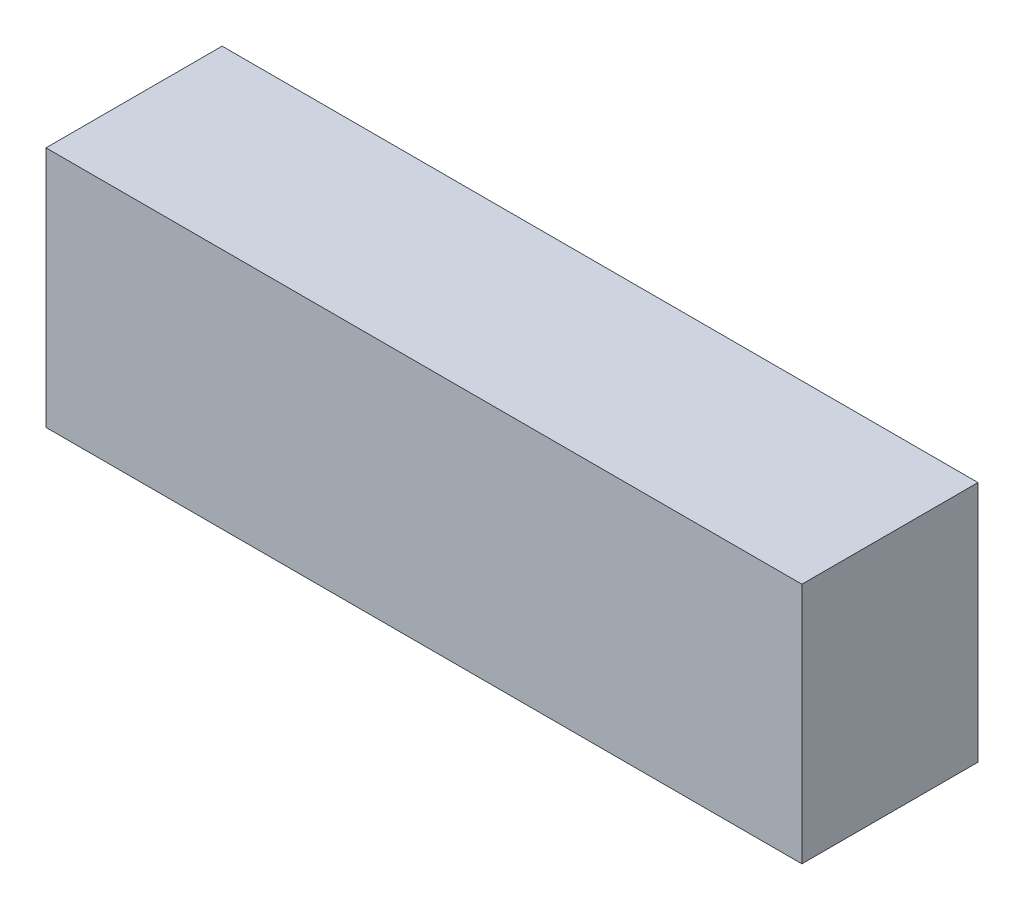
from build123d import *

# Parameters (mm, degrees)
SKETCH1_W           = 103
SKETCH1_H           = 33
BOSS_EXTRUDE1_DEPTH = 24


with BuildPart() as part:
    # Sketch1 → Boss-Extrude1 (new body)
    with BuildSketch(Plane.XY):
        with Locations((2.751908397, 6.006679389)):
            Rectangle(SKETCH1_W, SKETCH1_H)
    extrude(amount=BOSS_EXTRUDE1_DEPTH)


solid = part.part
